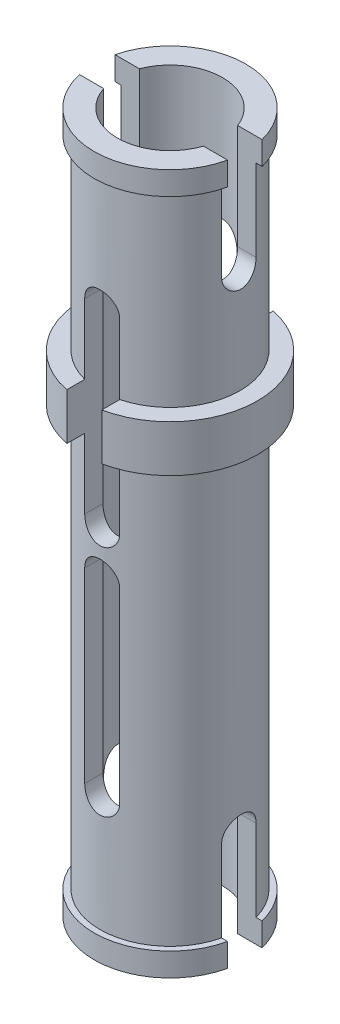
from build123d import *

# Parameters (mm, degrees)
BOSS_EXTRUDE1_DEPTH            = 8
BOSS_EXTRUDE1_DEPTH_BACK       = 16
SKETCH1_R                      = 2.4
BOSS_EXTRUDE2_DEPTH            = 0.8
BOSS_EXTRUDE2_DEPTH_BACK       = 0.8
SKETCH2_R                      = 3
SKETCH4_R                      = 2.6
BOSS_EXTRUDE3_DEPTH            = 0.8
BOSS_EXTRUDE5_START            = -0.8
SKETCH6_R                      = 2.6
BOSS_EXTRUDE5_DEPTH            = 0.8
CUT_EXTRUDE2_REACH             = 26.372
SKETCH7_R                      = 1.8
CUT_EXTRUDE3_REACH             = 18.553
CUT_EXTRUDE3_DIRECTION_2_REACH = 18.553
CUT_EXTRUDE4_REACH             = 18.542
CUT_EXTRUDE4_DIRECTION_2_REACH = 18.542


with BuildPart() as part:
    # Sketch1 → Boss-Extrude1 (new, two sides: drawn at the far end of the back side and taken through both)
    with BuildSketch(Plane(origin=(0, 0, 0), x_dir=(1, 0, 0), z_dir=(0, 1, 0)).offset(-BOSS_EXTRUDE1_DEPTH_BACK)):
        with Locations(Location((0, 0, 0), (0, 0, 270))):
            Circle(SKETCH1_R)
    extrude(amount=BOSS_EXTRUDE1_DEPTH + BOSS_EXTRUDE1_DEPTH_BACK)

    # Sketch2 → Boss-Extrude2 (add, two sides: drawn at the far end of the back side and taken through both)
    with BuildSketch(Plane(origin=(0, 0, 0), x_dir=(1, 0, 0), z_dir=(0, 1, 0)).offset(-BOSS_EXTRUDE2_DEPTH_BACK)):
        with Locations(Location((0, 0, 0), (0, 0, 270))):
            Circle(SKETCH2_R)
    extrude(amount=BOSS_EXTRUDE2_DEPTH + BOSS_EXTRUDE2_DEPTH_BACK)

    # Sketch4 → Boss-Extrude3 (add)
    with BuildSketch(Plane(origin=(0, 8, 0), x_dir=(1, 0, 0), z_dir=(0, 1, 0))):
        with Locations(Location((0, 0, 0), (0, 0, 270))):
            Circle(SKETCH4_R)
    extrude(amount=-BOSS_EXTRUDE3_DEPTH)

    # Sketch6 → Boss-Extrude5 (add)
    with BuildSketch(Plane.XZ.offset(16).offset(BOSS_EXTRUDE5_START)):
        with Locations(Location((0, 0, 0), (0, 0, 90))):
            Circle(SKETCH6_R)
    extrude(amount=BOSS_EXTRUDE5_DEPTH)

    # Sketch7 → Cut-Extrude2 (cut, up to next)
    with BuildSketch(Plane(origin=(0, 8, 0), x_dir=(1, 0, 0), z_dir=(0, 1, 0)), mode=Mode.PRIVATE) as cut_extrude2_sk1:
        with Locations(Location((0, 0, 0), (0, 0, 270))):
            Circle(SKETCH7_R)
    cut_extrude2_tool1 = extrude(cut_extrude2_sk1.sketch, amount=-CUT_EXTRUDE2_REACH, mode=Mode.PRIVATE) & part.part
    add(cut_extrude2_tool1.solids().sort_by_distance((0, 8, 0))[0], mode=Mode.SUBTRACT)

    # Sketch8 → Cut-Extrude3 (cut, up to next)
    with BuildSketch(Plane.XY, mode=Mode.PRIVATE) as cut_extrude3_sk1:
        with BuildLine():
            Line((-0.6, 3.2), (-0.6, -3.2))
            ThreePointArc((-0.6, -3.2), (0, -3.8), (0.6, -3.2))
            Line((0.6, -3.2), (0.6, 3.2))
            ThreePointArc((0.6, 3.2), (0, 3.8), (-0.6, 3.2))
        make_face()
    cut_extrude3_tool1 = extrude(cut_extrude3_sk1.sketch, amount=-CUT_EXTRUDE3_REACH, mode=Mode.PRIVATE) & part.part
    # Sketch8 → Cut-Extrude3 (cut, up to next)
    with BuildSketch(Plane.XY, mode=Mode.PRIVATE) as cut_extrude3_sk2:
        with BuildLine():
            Line((-0.6, -4.8), (-0.6, -11.2))
            ThreePointArc((-0.6, -11.2), (0, -11.8), (0.6, -11.2))
            Line((0.6, -11.2), (0.6, -4.8))
            ThreePointArc((0.6, -4.8), (0, -4.2), (-0.6, -4.8))
        make_face()
    cut_extrude3_tool2 = extrude(cut_extrude3_sk2.sketch, amount=-CUT_EXTRUDE3_REACH, mode=Mode.PRIVATE) & part.part
    add(cut_extrude3_tool1.solids().sort_by_distance((0, 0, 0))[0], mode=Mode.SUBTRACT)
    add(cut_extrude3_tool2.solids().sort_by_distance((0, -8, 0))[0], mode=Mode.SUBTRACT)

    # Sketch8 → Cut-Extrude3 direction 2 (cut, up to next)
    with BuildSketch(Plane.XY, mode=Mode.PRIVATE) as cut_extrude3_direction_2_sk1:
        with BuildLine():
            Line((-0.6, 3.2), (-0.6, -3.2))
            ThreePointArc((-0.6, -3.2), (0, -3.8), (0.6, -3.2))
            Line((0.6, -3.2), (0.6, 3.2))
            ThreePointArc((0.6, 3.2), (0, 3.8), (-0.6, 3.2))
        make_face()
    cut_extrude3_direction_2_tool1 = extrude(cut_extrude3_direction_2_sk1.sketch, amount=CUT_EXTRUDE3_DIRECTION_2_REACH, mode=Mode.PRIVATE) & part.part
    # Sketch8 → Cut-Extrude3 direction 2 (cut, up to next)
    with BuildSketch(Plane.XY, mode=Mode.PRIVATE) as cut_extrude3_direction_2_sk2:
        with BuildLine():
            Line((-0.6, -4.8), (-0.6, -11.2))
            ThreePointArc((-0.6, -11.2), (0, -11.8), (0.6, -11.2))
            Line((0.6, -11.2), (0.6, -4.8))
            ThreePointArc((0.6, -4.8), (0, -4.2), (-0.6, -4.8))
        make_face()
    cut_extrude3_direction_2_tool2 = extrude(cut_extrude3_direction_2_sk2.sketch, amount=CUT_EXTRUDE3_DIRECTION_2_REACH, mode=Mode.PRIVATE) & part.part
    add(cut_extrude3_direction_2_tool1.solids().sort_by_distance((0, 0, 0))[0], mode=Mode.SUBTRACT)
    add(cut_extrude3_direction_2_tool2.solids().sort_by_distance((0, -8, 0))[0], mode=Mode.SUBTRACT)

    # Sketch9 → Cut-Extrude4 (cut, up to next)
    with BuildSketch(Plane(origin=(0, 0, 0), x_dir=(0, 0, -1), z_dir=(1, 0, 0)), mode=Mode.PRIVATE) as cut_extrude4_sk1:
        with BuildLine():
            Line((-0.563999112, 8), (-0.563999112, 4.4))
            ThreePointArc((-0.563999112, 4.4), (0.036000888, 3.8), (0.636000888, 4.4))
            Line((0.636000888, 4.4), (0.636000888, 8))
            Line((0.636000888, 8), (-0.563999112, 8))
        make_face()
    cut_extrude4_tool1 = extrude(cut_extrude4_sk1.sketch, amount=-CUT_EXTRUDE4_REACH, mode=Mode.PRIVATE) & part.part
    # Sketch9 → Cut-Extrude4 (cut, up to next)
    with BuildSketch(Plane(origin=(0, 0, 0), x_dir=(0, 0, -1), z_dir=(1, 0, 0)), mode=Mode.PRIVATE) as cut_extrude4_sk2:
        with BuildLine():
            Line((-0.563999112, -16), (-0.563999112, -12.4))
            ThreePointArc((-0.563999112, -12.4), (0.036000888, -11.8), (0.636000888, -12.4))
            Line((0.636000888, -12.4), (0.636000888, -16))
            Line((0.636000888, -16), (-0.563999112, -16))
        make_face()
    cut_extrude4_tool2 = extrude(cut_extrude4_sk2.sketch, amount=-CUT_EXTRUDE4_REACH, mode=Mode.PRIVATE) & part.part
    add(cut_extrude4_tool1.solids().sort_by_distance((0, 5.962178, -0.036001))[0], mode=Mode.SUBTRACT)
    add(cut_extrude4_tool2.solids().sort_by_distance((0, -13.962178, -0.036001))[0], mode=Mode.SUBTRACT)

    # Sketch9 → Cut-Extrude4 direction 2 (cut, up to next)
    with BuildSketch(Plane(origin=(0, 0, 0), x_dir=(0, 0, -1), z_dir=(1, 0, 0)), mode=Mode.PRIVATE) as cut_extrude4_direction_2_sk1:
        with BuildLine():
            Line((-0.563999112, 8), (-0.563999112, 4.4))
            ThreePointArc((-0.563999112, 4.4), (0.036000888, 3.8), (0.636000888, 4.4))
            Line((0.636000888, 4.4), (0.636000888, 8))
            Line((0.636000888, 8), (-0.563999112, 8))
        make_face()
    cut_extrude4_direction_2_tool1 = extrude(cut_extrude4_direction_2_sk1.sketch, amount=CUT_EXTRUDE4_DIRECTION_2_REACH, mode=Mode.PRIVATE) & part.part
    # Sketch9 → Cut-Extrude4 direction 2 (cut, up to next)
    with BuildSketch(Plane(origin=(0, 0, 0), x_dir=(0, 0, -1), z_dir=(1, 0, 0)), mode=Mode.PRIVATE) as cut_extrude4_direction_2_sk2:
        with BuildLine():
            Line((-0.563999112, -16), (-0.563999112, -12.4))
            ThreePointArc((-0.563999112, -12.4), (0.036000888, -11.8), (0.636000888, -12.4))
            Line((0.636000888, -12.4), (0.636000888, -16))
            Line((0.636000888, -16), (-0.563999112, -16))
        make_face()
    cut_extrude4_direction_2_tool2 = extrude(cut_extrude4_direction_2_sk2.sketch, amount=CUT_EXTRUDE4_DIRECTION_2_REACH, mode=Mode.PRIVATE) & part.part
    add(cut_extrude4_direction_2_tool1.solids().sort_by_distance((0, 5.962178, -0.036001))[0], mode=Mode.SUBTRACT)
    add(cut_extrude4_direction_2_tool2.solids().sort_by_distance((0, -13.962178, -0.036001))[0], mode=Mode.SUBTRACT)


solid = part.part
